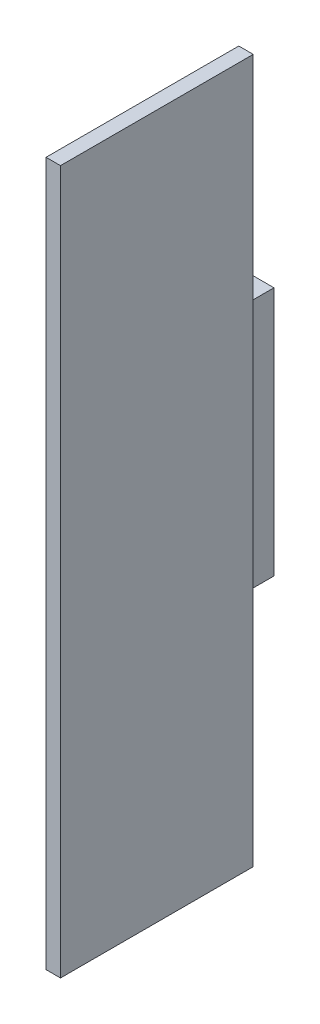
ISO-10303-21;
HEADER;
FILE_DESCRIPTION(('STEP AP214'),'2;1');
FILE_NAME('part.step','',(''),(''),'','','');
FILE_SCHEMA(('AUTOMOTIVE_DESIGN { 1 0 10303 214 1 1 1 1 }'));
ENDSEC;
DATA;
#1=APPLICATION_CONTEXT('core data for automotive mechanical design processes');
#2=APPLICATION_PROTOCOL_DEFINITION('international standard','automotive_design',2000,#1);
#3=PRODUCT_CONTEXT('',#1,'mechanical');
#4=PRODUCT('Part','Part','',(#3));
#5=PRODUCT_RELATED_PRODUCT_CATEGORY('part','',(#4));
#6=PRODUCT_DEFINITION_FORMATION('','',#4);
#7=PRODUCT_DEFINITION_CONTEXT('part definition',#1,'design');
#8=PRODUCT_DEFINITION('design','',#6,#7);
#9=PRODUCT_DEFINITION_SHAPE('','',#8);
#10=(LENGTH_UNIT() NAMED_UNIT(*) SI_UNIT(.MILLI.,.METRE.));
#11=(NAMED_UNIT(*) PLANE_ANGLE_UNIT() SI_UNIT($,.RADIAN.));
#12=(NAMED_UNIT(*) SI_UNIT($,.STERADIAN.) SOLID_ANGLE_UNIT());
#13=UNCERTAINTY_MEASURE_WITH_UNIT(LENGTH_MEASURE(1.E-05),#10,'distance_accuracy_value','');
#14=(GEOMETRIC_REPRESENTATION_CONTEXT(3) GLOBAL_UNCERTAINTY_ASSIGNED_CONTEXT((#13)) GLOBAL_UNIT_ASSIGNED_CONTEXT((#10,
#11,#12)) REPRESENTATION_CONTEXT('',''));
#15=CARTESIAN_POINT('',(0.,0.,0.));
#16=DIRECTION('',(0.,0.,1.));
#17=DIRECTION('',(1.,0.,0.));
#18=AXIS2_PLACEMENT_3D('',#15,#16,#17);
#19=CARTESIAN_POINT('',(3.,73.,40.));
#20=DIRECTION('',(0.,0.,-1.));
#21=DIRECTION('',(0.,1.,0.));
#22=AXIS2_PLACEMENT_3D('',#19,#20,#21);
#23=PLANE('',#22);
#24=DIRECTION('',(0.,-1.,0.));
#25=VECTOR('',#24,1.);
#26=CARTESIAN_POINT('',(0.,73.,40.));
#27=LINE('',#26,#25);
#28=CARTESIAN_POINT('',(0.,73.,40.));
#29=VERTEX_POINT('',#28);
#30=CARTESIAN_POINT('',(0.,-73.,40.));
#31=VERTEX_POINT('',#30);
#32=EDGE_CURVE('E155',#29,#31,#27,.T.);
#33=ORIENTED_EDGE('',*,*,#32,.T.);
#34=DIRECTION('',(-1.,0.,0.));
#35=VECTOR('',#34,1.);
#36=CARTESIAN_POINT('',(3.,-73.,40.));
#37=LINE('',#36,#35);
#38=CARTESIAN_POINT('',(3.,-73.,40.));
#39=VERTEX_POINT('',#38);
#40=EDGE_CURVE('E9',#39,#31,#37,.T.);
#41=ORIENTED_EDGE('',*,*,#40,.F.);
#42=DIRECTION('',(0.,-1.,0.));
#43=VECTOR('',#42,1.);
#44=CARTESIAN_POINT('',(3.,73.,40.));
#45=LINE('',#44,#43);
#46=CARTESIAN_POINT('',(3.,73.,40.));
#47=VERTEX_POINT('',#46);
#48=EDGE_CURVE('E196',#47,#39,#45,.T.);
#49=ORIENTED_EDGE('',*,*,#48,.F.);
#50=DIRECTION('',(-1.,0.,0.));
#51=VECTOR('',#50,1.);
#52=CARTESIAN_POINT('',(3.,73.,40.));
#53=LINE('',#52,#51);
#54=EDGE_CURVE('E193',#47,#29,#53,.T.);
#55=ORIENTED_EDGE('',*,*,#54,.T.);
#56=EDGE_LOOP('',(#33,#41,#49,#55));
#57=FACE_BOUND('',#56,.T.);
#58=ADVANCED_FACE('F14',(#57),#23,.F.);
#59=CARTESIAN_POINT('',(3.,-73.,40.));
#60=DIRECTION('',(0.,1.,0.));
#61=DIRECTION('',(-1.,0.,0.));
#62=AXIS2_PLACEMENT_3D('',#59,#60,#61);
#63=PLANE('',#62);
#64=DIRECTION('',(0.,0.,-1.));
#65=VECTOR('',#64,1.);
#66=CARTESIAN_POINT('',(0.,-73.,40.));
#67=LINE('',#66,#65);
#68=CARTESIAN_POINT('',(0.,-73.,0.));
#69=VERTEX_POINT('',#68);
#70=EDGE_CURVE('E165',#31,#69,#67,.T.);
#71=ORIENTED_EDGE('',*,*,#70,.T.);
#72=DIRECTION('',(-1.,0.,0.));
#73=VECTOR('',#72,1.);
#74=CARTESIAN_POINT('',(3.,-73.,0.));
#75=LINE('',#74,#73);
#76=CARTESIAN_POINT('',(3.,-73.,0.));
#77=VERTEX_POINT('',#76);
#78=EDGE_CURVE('E23',#77,#69,#75,.T.);
#79=ORIENTED_EDGE('',*,*,#78,.F.);
#80=DIRECTION('',(0.,0.,-1.));
#81=VECTOR('',#80,1.);
#82=CARTESIAN_POINT('',(3.,-73.,40.));
#83=LINE('',#82,#81);
#84=EDGE_CURVE('E197',#39,#77,#83,.T.);
#85=ORIENTED_EDGE('',*,*,#84,.F.);
#86=ORIENTED_EDGE('',*,*,#40,.T.);
#87=EDGE_LOOP('',(#71,#79,#85,#86));
#88=FACE_BOUND('',#87,.T.);
#89=ADVANCED_FACE('F208',(#88),#63,.F.);
#90=CARTESIAN_POINT('',(3.,-73.,0.));
#91=DIRECTION('',(0.,0.,1.));
#92=DIRECTION('',(1.,0.,0.));
#93=AXIS2_PLACEMENT_3D('',#90,#91,#92);
#94=PLANE('',#93);
#95=DIRECTION('',(0.,1.,0.));
#96=VECTOR('',#95,1.);
#97=CARTESIAN_POINT('',(0.,-73.,0.));
#98=LINE('',#97,#96);
#99=CARTESIAN_POINT('',(0.,-35.,0.));
#100=VERTEX_POINT('',#99);
#101=EDGE_CURVE('E178',#69,#100,#98,.T.);
#102=ORIENTED_EDGE('',*,*,#101,.T.);
#103=DIRECTION('',(1.,0.,0.));
#104=VECTOR('',#103,1.);
#105=CARTESIAN_POINT('',(-6.,-35.,0.));
#106=LINE('',#105,#104);
#107=CARTESIAN_POINT('',(-6.,-35.,0.));
#108=VERTEX_POINT('',#107);
#109=EDGE_CURVE('E112',#108,#100,#106,.T.);
#110=ORIENTED_EDGE('',*,*,#109,.F.);
#111=DIRECTION('',(0.,1.,0.));
#112=VECTOR('',#111,1.);
#113=CARTESIAN_POINT('',(-6.,-35.,0.));
#114=LINE('',#113,#112);
#115=CARTESIAN_POINT('',(-6.,-25.9,0.));
#116=VERTEX_POINT('',#115);
#117=EDGE_CURVE('E136',#108,#116,#114,.T.);
#118=ORIENTED_EDGE('',*,*,#117,.T.);
#119=DIRECTION('',(1.,0.,0.));
#120=VECTOR('',#119,1.);
#121=CARTESIAN_POINT('',(-6.,-25.9,0.));
#122=LINE('',#121,#120);
#123=CARTESIAN_POINT('',(0.,-25.9,0.));
#124=VERTEX_POINT('',#123);
#125=EDGE_CURVE('E161',#116,#124,#122,.T.);
#126=ORIENTED_EDGE('',*,*,#125,.T.);
#127=CARTESIAN_POINT('',(0.,25.9,0.));
#128=VERTEX_POINT('',#127);
#129=EDGE_CURVE('E179',#124,#128,#98,.T.);
#130=ORIENTED_EDGE('',*,*,#129,.T.);
#131=DIRECTION('',(1.,0.,0.));
#132=VECTOR('',#131,1.);
#133=CARTESIAN_POINT('',(-6.,25.9,0.));
#134=LINE('',#133,#132);
#135=CARTESIAN_POINT('',(-6.,25.9,0.));
#136=VERTEX_POINT('',#135);
#137=EDGE_CURVE('E159',#136,#128,#134,.T.);
#138=ORIENTED_EDGE('',*,*,#137,.F.);
#139=DIRECTION('',(0.,1.,0.));
#140=VECTOR('',#139,1.);
#141=CARTESIAN_POINT('',(-6.,25.9,0.));
#142=LINE('',#141,#140);
#143=CARTESIAN_POINT('',(-6.,34.9999999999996,0.));
#144=VERTEX_POINT('',#143);
#145=EDGE_CURVE('E148',#136,#144,#142,.T.);
#146=ORIENTED_EDGE('',*,*,#145,.T.);
#147=DIRECTION('',(1.,0.,0.));
#148=VECTOR('',#147,1.);
#149=CARTESIAN_POINT('',(-6.,34.9999999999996,0.));
#150=LINE('',#149,#148);
#151=CARTESIAN_POINT('',(0.,34.9999999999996,0.));
#152=VERTEX_POINT('',#151);
#153=EDGE_CURVE('E156',#144,#152,#150,.T.);
#154=ORIENTED_EDGE('',*,*,#153,.T.);
#155=CARTESIAN_POINT('',(0.,73.,0.));
#156=VERTEX_POINT('',#155);
#157=EDGE_CURVE('E167',#152,#156,#98,.T.);
#158=ORIENTED_EDGE('',*,*,#157,.T.);
#159=DIRECTION('',(-1.,0.,0.));
#160=VECTOR('',#159,1.);
#161=CARTESIAN_POINT('',(3.,73.,0.));
#162=LINE('',#161,#160);
#163=CARTESIAN_POINT('',(3.,73.,0.));
#164=VERTEX_POINT('',#163);
#165=EDGE_CURVE('E188',#164,#156,#162,.T.);
#166=ORIENTED_EDGE('',*,*,#165,.F.);
#167=DIRECTION('',(0.,1.,0.));
#168=VECTOR('',#167,1.);
#169=CARTESIAN_POINT('',(3.,-73.,0.));
#170=LINE('',#169,#168);
#171=EDGE_CURVE('E200',#77,#164,#170,.T.);
#172=ORIENTED_EDGE('',*,*,#171,.F.);
#173=ORIENTED_EDGE('',*,*,#78,.T.);
#174=EDGE_LOOP('',(#102,#110,#118,#126,#130,#138,#146,#154,#158,#166,#172,#173));
#175=FACE_BOUND('',#174,.T.);
#176=ADVANCED_FACE('F186',(#175),#94,.F.);
#177=CARTESIAN_POINT('',(3.,73.,0.));
#178=DIRECTION('',(0.,-1.,0.));
#179=DIRECTION('',(1.,0.,0.));
#180=AXIS2_PLACEMENT_3D('',#177,#178,#179);
#181=PLANE('',#180);
#182=DIRECTION('',(0.,0.,1.));
#183=VECTOR('',#182,1.);
#184=CARTESIAN_POINT('',(0.,73.,0.));
#185=LINE('',#184,#183);
#186=EDGE_CURVE('E170',#156,#29,#185,.T.);
#187=ORIENTED_EDGE('',*,*,#186,.T.);
#188=ORIENTED_EDGE('',*,*,#54,.F.);
#189=DIRECTION('',(0.,0.,1.));
#190=VECTOR('',#189,1.);
#191=CARTESIAN_POINT('',(3.,73.,0.));
#192=LINE('',#191,#190);
#193=EDGE_CURVE('E39',#164,#47,#192,.T.);
#194=ORIENTED_EDGE('',*,*,#193,.F.);
#195=ORIENTED_EDGE('',*,*,#165,.T.);
#196=EDGE_LOOP('',(#187,#188,#194,#195));
#197=FACE_BOUND('',#196,.T.);
#198=ADVANCED_FACE('F191',(#197),#181,.F.);
#199=CARTESIAN_POINT('',(3.,-73.,40.));
#200=DIRECTION('',(1.,0.,0.));
#201=DIRECTION('',(0.,1.,0.));
#202=AXIS2_PLACEMENT_3D('',#199,#200,#201);
#203=PLANE('',#202);
#204=ORIENTED_EDGE('',*,*,#48,.T.);
#205=ORIENTED_EDGE('',*,*,#84,.T.);
#206=ORIENTED_EDGE('',*,*,#171,.T.);
#207=ORIENTED_EDGE('',*,*,#193,.T.);
#208=EDGE_LOOP('',(#204,#205,#206,#207));
#209=FACE_BOUND('',#208,.T.);
#210=ADVANCED_FACE('F224',(#209),#203,.T.);
#211=CARTESIAN_POINT('',(0.,-73.,40.));
#212=DIRECTION('',(1.,0.,0.));
#213=DIRECTION('',(0.,1.,0.));
#214=AXIS2_PLACEMENT_3D('',#211,#212,#213);
#215=PLANE('',#214);
#216=DIRECTION('',(0.,-1.,0.));
#217=VECTOR('',#216,1.);
#218=CARTESIAN_POINT('',(0.,-35.,7.69999999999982));
#219=LINE('',#218,#217);
#220=CARTESIAN_POINT('',(0.,35.,7.69999999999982));
#221=VERTEX_POINT('',#220);
#222=CARTESIAN_POINT('',(0.,-35.,7.69999999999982));
#223=VERTEX_POINT('',#222);
#224=EDGE_CURVE('E31',#221,#223,#219,.T.);
#225=ORIENTED_EDGE('',*,*,#224,.T.);
#226=DIRECTION('',(0.,0.,-1.));
#227=VECTOR('',#226,1.);
#228=CARTESIAN_POINT('',(0.,-35.,0.));
#229=LINE('',#228,#227);
#230=EDGE_CURVE('E17',#223,#100,#229,.T.);
#231=ORIENTED_EDGE('',*,*,#230,.T.);
#232=ORIENTED_EDGE('',*,*,#101,.F.);
#233=ORIENTED_EDGE('',*,*,#70,.F.);
#234=ORIENTED_EDGE('',*,*,#32,.F.);
#235=ORIENTED_EDGE('',*,*,#186,.F.);
#236=ORIENTED_EDGE('',*,*,#157,.F.);
#237=DIRECTION('',(0.,0.,1.));
#238=VECTOR('',#237,1.);
#239=CARTESIAN_POINT('',(0.,35.,7.69999999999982));
#240=LINE('',#239,#238);
#241=EDGE_CURVE('E125',#152,#221,#240,.T.);
#242=ORIENTED_EDGE('',*,*,#241,.T.);
#243=EDGE_LOOP('',(#225,#231,#232,#233,#234,#235,#236,#242));
#244=FACE_BOUND('',#243,.T.);
#245=ADVANCED_FACE('F122',(#244),#215,.F.);
#246=CARTESIAN_POINT('',(0.,25.9,7.69999999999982));
#247=DIRECTION('',(1.,0.,0.));
#248=DIRECTION('',(0.,1.,0.));
#249=AXIS2_PLACEMENT_3D('',#246,#247,#248);
#250=PLANE('',#249);
#251=ORIENTED_EDGE('',*,*,#129,.F.);
#252=DIRECTION('',(0.,0.,-1.));
#253=VECTOR('',#252,1.);
#254=CARTESIAN_POINT('',(0.,-25.9,0.));
#255=LINE('',#254,#253);
#256=CARTESIAN_POINT('',(0.,-25.9,-7.30000000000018));
#257=VERTEX_POINT('',#256);
#258=EDGE_CURVE('E120',#124,#257,#255,.T.);
#259=ORIENTED_EDGE('',*,*,#258,.T.);
#260=DIRECTION('',(0.,1.,0.));
#261=VECTOR('',#260,1.);
#262=CARTESIAN_POINT('',(0.,-25.9,-7.30000000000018));
#263=LINE('',#262,#261);
#264=CARTESIAN_POINT('',(0.,25.9,-7.30000000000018));
#265=VERTEX_POINT('',#264);
#266=EDGE_CURVE('E129',#257,#265,#263,.T.);
#267=ORIENTED_EDGE('',*,*,#266,.T.);
#268=DIRECTION('',(0.,0.,1.));
#269=VECTOR('',#268,1.);
#270=CARTESIAN_POINT('',(0.,25.9,-7.30000000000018));
#271=LINE('',#270,#269);
#272=EDGE_CURVE('E132',#265,#128,#271,.T.);
#273=ORIENTED_EDGE('',*,*,#272,.T.);
#274=EDGE_LOOP('',(#251,#259,#267,#273));
#275=FACE_BOUND('',#274,.T.);
#276=ADVANCED_FACE('F229',(#275),#250,.T.);
#277=CARTESIAN_POINT('',(-6.,-35.,7.69999999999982));
#278=DIRECTION('',(0.,0.,1.));
#279=DIRECTION('',(1.,0.,0.));
#280=AXIS2_PLACEMENT_3D('',#277,#278,#279);
#281=PLANE('',#280);
#282=ORIENTED_EDGE('',*,*,#224,.F.);
#283=DIRECTION('',(1.,0.,0.));
#284=VECTOR('',#283,1.);
#285=CARTESIAN_POINT('',(-6.,35.,7.69999999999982));
#286=LINE('',#285,#284);
#287=CARTESIAN_POINT('',(-6.,35.,7.69999999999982));
#288=VERTEX_POINT('',#287);
#289=EDGE_CURVE('E153',#288,#221,#286,.T.);
#290=ORIENTED_EDGE('',*,*,#289,.F.);
#291=DIRECTION('',(0.,-1.,0.));
#292=VECTOR('',#291,1.);
#293=CARTESIAN_POINT('',(-6.,-35.,7.69999999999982));
#294=LINE('',#293,#292);
#295=CARTESIAN_POINT('',(-6.,-35.,7.69999999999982));
#296=VERTEX_POINT('',#295);
#297=EDGE_CURVE('E108',#288,#296,#294,.T.);
#298=ORIENTED_EDGE('',*,*,#297,.T.);
#299=DIRECTION('',(1.,0.,0.));
#300=VECTOR('',#299,1.);
#301=CARTESIAN_POINT('',(-6.,-35.,7.69999999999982));
#302=LINE('',#301,#300);
#303=EDGE_CURVE('E104',#296,#223,#302,.T.);
#304=ORIENTED_EDGE('',*,*,#303,.T.);
#305=EDGE_LOOP('',(#282,#290,#298,#304));
#306=FACE_BOUND('',#305,.T.);
#307=ADVANCED_FACE('F106',(#306),#281,.T.);
#308=CARTESIAN_POINT('',(-6.,35.,7.69999999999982));
#309=DIRECTION('',(0.,1.,0.));
#310=DIRECTION('',(0.,0.,1.));
#311=AXIS2_PLACEMENT_3D('',#308,#309,#310);
#312=PLANE('',#311);
#313=ORIENTED_EDGE('',*,*,#241,.F.);
#314=ORIENTED_EDGE('',*,*,#153,.F.);
#315=DIRECTION('',(0.,0.,1.));
#316=VECTOR('',#315,1.);
#317=CARTESIAN_POINT('',(-6.,35.,7.69999999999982));
#318=LINE('',#317,#316);
#319=EDGE_CURVE('E113',#144,#288,#318,.T.);
#320=ORIENTED_EDGE('',*,*,#319,.T.);
#321=ORIENTED_EDGE('',*,*,#289,.T.);
#322=EDGE_LOOP('',(#313,#314,#320,#321));
#323=FACE_BOUND('',#322,.T.);
#324=ADVANCED_FACE('F232',(#323),#312,.T.);
#325=CARTESIAN_POINT('',(-6.,25.9,-7.30000000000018));
#326=DIRECTION('',(0.,1.,0.));
#327=DIRECTION('',(-1.,0.,0.));
#328=AXIS2_PLACEMENT_3D('',#325,#326,#327);
#329=PLANE('',#328);
#330=ORIENTED_EDGE('',*,*,#272,.F.);
#331=DIRECTION('',(1.,0.,0.));
#332=VECTOR('',#331,1.);
#333=CARTESIAN_POINT('',(-6.,25.9,-7.30000000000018));
#334=LINE('',#333,#332);
#335=CARTESIAN_POINT('',(-6.,25.9,-7.30000000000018));
#336=VERTEX_POINT('',#335);
#337=EDGE_CURVE('E157',#336,#265,#334,.T.);
#338=ORIENTED_EDGE('',*,*,#337,.F.);
#339=DIRECTION('',(0.,0.,1.));
#340=VECTOR('',#339,1.);
#341=CARTESIAN_POINT('',(-6.,25.9,-7.30000000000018));
#342=LINE('',#341,#340);
#343=EDGE_CURVE('E145',#336,#136,#342,.T.);
#344=ORIENTED_EDGE('',*,*,#343,.T.);
#345=ORIENTED_EDGE('',*,*,#137,.T.);
#346=EDGE_LOOP('',(#330,#338,#344,#345));
#347=FACE_BOUND('',#346,.T.);
#348=ADVANCED_FACE('F243',(#347),#329,.T.);
#349=CARTESIAN_POINT('',(-6.,-25.9,-7.30000000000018));
#350=DIRECTION('',(0.,0.,-1.));
#351=DIRECTION('',(-1.,0.,0.));
#352=AXIS2_PLACEMENT_3D('',#349,#350,#351);
#353=PLANE('',#352);
#354=ORIENTED_EDGE('',*,*,#266,.F.);
#355=DIRECTION('',(1.,0.,0.));
#356=VECTOR('',#355,1.);
#357=CARTESIAN_POINT('',(-6.,-25.9,-7.30000000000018));
#358=LINE('',#357,#356);
#359=CARTESIAN_POINT('',(-6.,-25.9,-7.30000000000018));
#360=VERTEX_POINT('',#359);
#361=EDGE_CURVE('E160',#360,#257,#358,.T.);
#362=ORIENTED_EDGE('',*,*,#361,.F.);
#363=DIRECTION('',(0.,1.,0.));
#364=VECTOR('',#363,1.);
#365=CARTESIAN_POINT('',(-6.,-25.9,-7.30000000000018));
#366=LINE('',#365,#364);
#367=EDGE_CURVE('E142',#360,#336,#366,.T.);
#368=ORIENTED_EDGE('',*,*,#367,.T.);
#369=ORIENTED_EDGE('',*,*,#337,.T.);
#370=EDGE_LOOP('',(#354,#362,#368,#369));
#371=FACE_BOUND('',#370,.T.);
#372=ADVANCED_FACE('F239',(#371),#353,.T.);
#373=CARTESIAN_POINT('',(-6.,-25.9,0.));
#374=DIRECTION('',(0.,-1.,0.));
#375=DIRECTION('',(1.,0.,0.));
#376=AXIS2_PLACEMENT_3D('',#373,#374,#375);
#377=PLANE('',#376);
#378=ORIENTED_EDGE('',*,*,#258,.F.);
#379=ORIENTED_EDGE('',*,*,#125,.F.);
#380=DIRECTION('',(0.,0.,-1.));
#381=VECTOR('',#380,1.);
#382=CARTESIAN_POINT('',(-6.,-25.9,0.));
#383=LINE('',#382,#381);
#384=EDGE_CURVE('E139',#116,#360,#383,.T.);
#385=ORIENTED_EDGE('',*,*,#384,.T.);
#386=ORIENTED_EDGE('',*,*,#361,.T.);
#387=EDGE_LOOP('',(#378,#379,#385,#386));
#388=FACE_BOUND('',#387,.T.);
#389=ADVANCED_FACE('F236',(#388),#377,.T.);
#390=CARTESIAN_POINT('',(-6.,-35.,0.));
#391=DIRECTION('',(0.,-1.,0.));
#392=DIRECTION('',(1.,0.,0.));
#393=AXIS2_PLACEMENT_3D('',#390,#391,#392);
#394=PLANE('',#393);
#395=ORIENTED_EDGE('',*,*,#230,.F.);
#396=ORIENTED_EDGE('',*,*,#303,.F.);
#397=DIRECTION('',(0.,0.,-1.));
#398=VECTOR('',#397,1.);
#399=CARTESIAN_POINT('',(-6.,-35.,0.));
#400=LINE('',#399,#398);
#401=EDGE_CURVE('E134',#296,#108,#400,.T.);
#402=ORIENTED_EDGE('',*,*,#401,.T.);
#403=ORIENTED_EDGE('',*,*,#109,.T.);
#404=EDGE_LOOP('',(#395,#396,#402,#403));
#405=FACE_BOUND('',#404,.T.);
#406=ADVANCED_FACE('F116',(#405),#394,.T.);
#407=CARTESIAN_POINT('',(-6.,25.9,7.69999999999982));
#408=DIRECTION('',(1.,0.,0.));
#409=DIRECTION('',(0.,1.,0.));
#410=AXIS2_PLACEMENT_3D('',#407,#408,#409);
#411=PLANE('',#410);
#412=ORIENTED_EDGE('',*,*,#297,.F.);
#413=ORIENTED_EDGE('',*,*,#319,.F.);
#414=ORIENTED_EDGE('',*,*,#145,.F.);
#415=ORIENTED_EDGE('',*,*,#343,.F.);
#416=ORIENTED_EDGE('',*,*,#367,.F.);
#417=ORIENTED_EDGE('',*,*,#384,.F.);
#418=ORIENTED_EDGE('',*,*,#117,.F.);
#419=ORIENTED_EDGE('',*,*,#401,.F.);
#420=EDGE_LOOP('',(#412,#413,#414,#415,#416,#417,#418,#419));
#421=FACE_BOUND('',#420,.T.);
#422=ADVANCED_FACE('F235',(#421),#411,.F.);
#423=CLOSED_SHELL('',(#58,#89,#176,#198,#210,#245,#276,#307,#324,#348,#372,#389,#406,#422));
#424=MANIFOLD_SOLID_BREP('B1',#423);
#425=ADVANCED_BREP_SHAPE_REPRESENTATION('',(#18,#424),#14);
#426=SHAPE_DEFINITION_REPRESENTATION(#9,#425);
ENDSEC;
END-ISO-10303-21;
